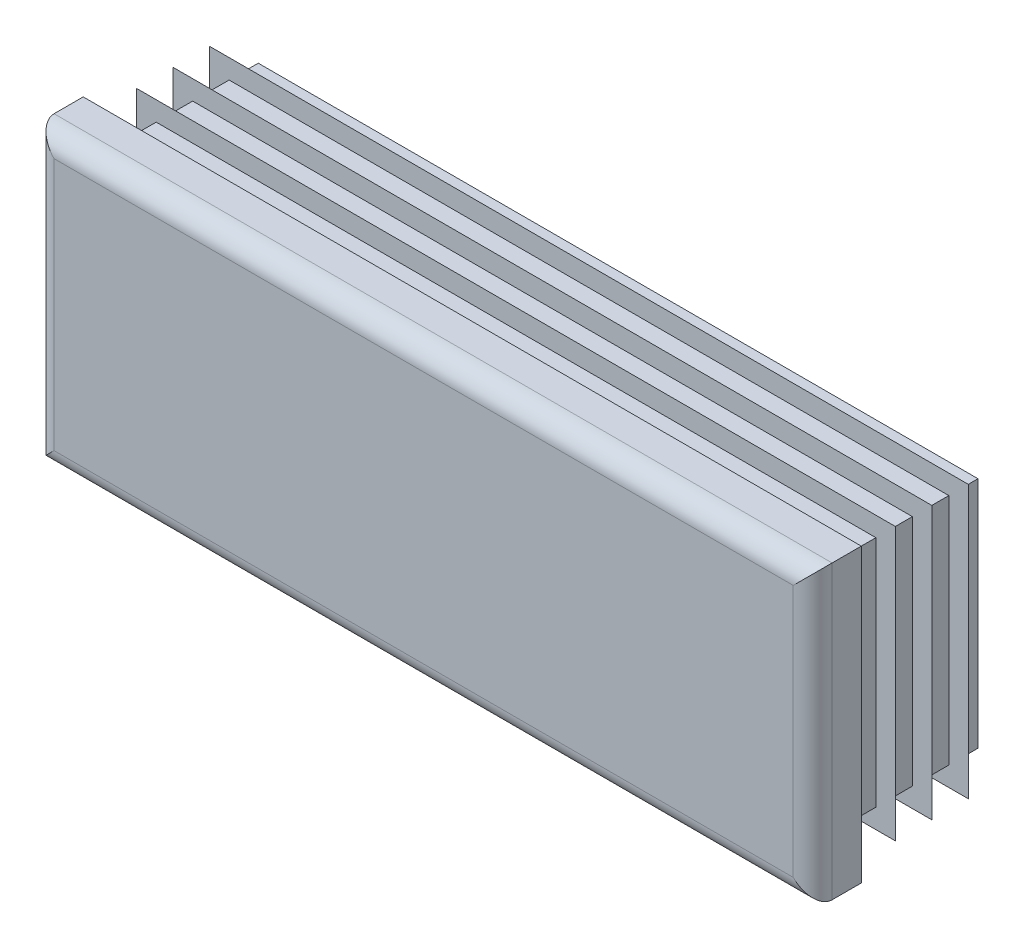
ISO-10303-21;
HEADER;
FILE_DESCRIPTION(('STEP AP214'),'2;1');
FILE_NAME('part.step','',(''),(''),'','','');
FILE_SCHEMA(('AUTOMOTIVE_DESIGN { 1 0 10303 214 1 1 1 1 }'));
ENDSEC;
DATA;
#1=APPLICATION_CONTEXT('core data for automotive mechanical design processes');
#2=APPLICATION_PROTOCOL_DEFINITION('international standard','automotive_design',2000,#1);
#3=PRODUCT_CONTEXT('',#1,'mechanical');
#4=PRODUCT('Part','Part','',(#3));
#5=PRODUCT_RELATED_PRODUCT_CATEGORY('part','',(#4));
#6=PRODUCT_DEFINITION_FORMATION('','',#4);
#7=PRODUCT_DEFINITION_CONTEXT('part definition',#1,'design');
#8=PRODUCT_DEFINITION('design','',#6,#7);
#9=PRODUCT_DEFINITION_SHAPE('','',#8);
#10=(LENGTH_UNIT() NAMED_UNIT(*) SI_UNIT(.MILLI.,.METRE.));
#11=(NAMED_UNIT(*) PLANE_ANGLE_UNIT() SI_UNIT($,.RADIAN.));
#12=(NAMED_UNIT(*) SI_UNIT($,.STERADIAN.) SOLID_ANGLE_UNIT());
#13=UNCERTAINTY_MEASURE_WITH_UNIT(LENGTH_MEASURE(1.E-05),#10,'distance_accuracy_value','');
#14=(GEOMETRIC_REPRESENTATION_CONTEXT(3) GLOBAL_UNCERTAINTY_ASSIGNED_CONTEXT((#13)) GLOBAL_UNIT_ASSIGNED_CONTEXT((#10,
#11,#12)) REPRESENTATION_CONTEXT('',''));
#15=CARTESIAN_POINT('',(0.,0.,0.));
#16=DIRECTION('',(0.,0.,1.));
#17=DIRECTION('',(1.,0.,0.));
#18=AXIS2_PLACEMENT_3D('',#15,#16,#17);
#19=CARTESIAN_POINT('',(38.,-15.,5.));
#20=DIRECTION('',(0.,0.,-1.));
#21=DIRECTION('',(0.,1.,0.));
#22=AXIS2_PLACEMENT_3D('',#19,#20,#21);
#23=PLANE('',#22);
#24=DIRECTION('',(0.,1.,0.));
#25=VECTOR('',#24,1.);
#26=CARTESIAN_POINT('',(-38.,-15.,5.));
#27=LINE('',#26,#25);
#28=CARTESIAN_POINT('',(-38.,-13.,5.));
#29=VERTEX_POINT('',#28);
#30=CARTESIAN_POINT('',(-38.,13.,5.));
#31=VERTEX_POINT('',#30);
#32=EDGE_CURVE('E310',#29,#31,#27,.T.);
#33=ORIENTED_EDGE('',*,*,#32,.F.);
#34=DIRECTION('',(-1.,0.,0.));
#35=VECTOR('',#34,1.);
#36=CARTESIAN_POINT('',(40.,-13.,5.));
#37=LINE('',#36,#35);
#38=CARTESIAN_POINT('',(38.,-13.,5.));
#39=VERTEX_POINT('',#38);
#40=EDGE_CURVE('E482',#39,#29,#37,.T.);
#41=ORIENTED_EDGE('',*,*,#40,.F.);
#42=DIRECTION('',(0.,1.,0.));
#43=VECTOR('',#42,1.);
#44=CARTESIAN_POINT('',(38.,-15.,5.));
#45=LINE('',#44,#43);
#46=CARTESIAN_POINT('',(38.,13.,5.));
#47=VERTEX_POINT('',#46);
#48=EDGE_CURVE('E305',#39,#47,#45,.T.);
#49=ORIENTED_EDGE('',*,*,#48,.T.);
#50=DIRECTION('',(-1.,0.,0.));
#51=VECTOR('',#50,1.);
#52=CARTESIAN_POINT('',(40.,13.,5.));
#53=LINE('',#52,#51);
#54=EDGE_CURVE('E630',#47,#31,#53,.T.);
#55=ORIENTED_EDGE('',*,*,#54,.T.);
#56=EDGE_LOOP('',(#33,#41,#49,#55));
#57=FACE_BOUND('',#56,.T.);
#58=ADVANCED_FACE('F14',(#57),#23,.F.);
#59=CARTESIAN_POINT('',(-38.,-15.,3.));
#60=DIRECTION('',(0.,1.,0.));
#61=DIRECTION('',(-1.,0.,0.));
#62=AXIS2_PLACEMENT_3D('',#59,#60,#61);
#63=CYLINDRICAL_SURFACE('',#62,2.);
#64=DIRECTION('',(0.,1.,0.));
#65=VECTOR('',#64,1.);
#66=CARTESIAN_POINT('',(-40.,-15.,3.));
#67=LINE('',#66,#65);
#68=CARTESIAN_POINT('',(-40.,-15.,3.));
#69=VERTEX_POINT('',#68);
#70=CARTESIAN_POINT('',(-40.,15.,3.));
#71=VERTEX_POINT('',#70);
#72=EDGE_CURVE('E402',#69,#71,#67,.T.);
#73=ORIENTED_EDGE('',*,*,#72,.F.);
#74=CARTESIAN_POINT('',(-38.,-13.,3.));
#75=DIRECTION('',(-0.707106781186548,0.707106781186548,0.));
#76=DIRECTION('',(0.707106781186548,0.707106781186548,0.));
#77=AXIS2_PLACEMENT_3D('',#74,#75,#76);
#78=ELLIPSE('',#77,2.82842712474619,2.);
#79=EDGE_CURVE('E59',#69,#29,#78,.T.);
#80=ORIENTED_EDGE('',*,*,#79,.T.);
#81=ORIENTED_EDGE('',*,*,#32,.T.);
#82=CARTESIAN_POINT('',(-38.,13.,3.));
#83=DIRECTION('',(0.707106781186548,0.707106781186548,0.));
#84=DIRECTION('',(-0.707106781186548,0.707106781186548,0.));
#85=AXIS2_PLACEMENT_3D('',#82,#83,#84);
#86=ELLIPSE('',#85,2.82842712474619,2.);
#87=EDGE_CURVE('E306',#31,#71,#86,.F.);
#88=ORIENTED_EDGE('',*,*,#87,.T.);
#89=EDGE_LOOP('',(#73,#80,#81,#88));
#90=FACE_BOUND('',#89,.T.);
#91=ADVANCED_FACE('F16',(#90),#63,.T.);
#92=CARTESIAN_POINT('',(-40.,-15.,3.));
#93=DIRECTION('',(1.,0.,0.));
#94=DIRECTION('',(0.,1.,0.));
#95=AXIS2_PLACEMENT_3D('',#92,#93,#94);
#96=PLANE('',#95);
#97=DIRECTION('',(0.,0.,-1.));
#98=VECTOR('',#97,1.);
#99=CARTESIAN_POINT('',(-40.,15.,3.));
#100=LINE('',#99,#98);
#101=CARTESIAN_POINT('',(-40.,15.,0.));
#102=VERTEX_POINT('',#101);
#103=EDGE_CURVE('E615',#71,#102,#100,.T.);
#104=ORIENTED_EDGE('',*,*,#103,.T.);
#105=DIRECTION('',(0.,1.,0.));
#106=VECTOR('',#105,1.);
#107=CARTESIAN_POINT('',(-40.,-15.,0.));
#108=LINE('',#107,#106);
#109=CARTESIAN_POINT('',(-40.,-15.,0.));
#110=VERTEX_POINT('',#109);
#111=EDGE_CURVE('E400',#110,#102,#108,.T.);
#112=ORIENTED_EDGE('',*,*,#111,.F.);
#113=DIRECTION('',(0.,0.,-1.));
#114=VECTOR('',#113,1.);
#115=CARTESIAN_POINT('',(-40.,-15.,3.));
#116=LINE('',#115,#114);
#117=EDGE_CURVE('E616',#69,#110,#116,.T.);
#118=ORIENTED_EDGE('',*,*,#117,.F.);
#119=ORIENTED_EDGE('',*,*,#72,.T.);
#120=EDGE_LOOP('',(#104,#112,#118,#119));
#121=FACE_BOUND('',#120,.T.);
#122=ADVANCED_FACE('F697',(#121),#96,.F.);
#123=CARTESIAN_POINT('',(-37.,-15.,0.));
#124=DIRECTION('',(1.,0.,0.));
#125=DIRECTION('',(0.,1.,0.));
#126=AXIS2_PLACEMENT_3D('',#123,#124,#125);
#127=PLANE('',#126);
#128=DIRECTION('',(0.,1.,0.));
#129=VECTOR('',#128,1.);
#130=CARTESIAN_POINT('',(-37.,-15.,0.));
#131=LINE('',#130,#129);
#132=CARTESIAN_POINT('',(-37.,-12.,0.));
#133=VERTEX_POINT('',#132);
#134=CARTESIAN_POINT('',(-37.,12.,0.));
#135=VERTEX_POINT('',#134);
#136=EDGE_CURVE('E397',#133,#135,#131,.T.);
#137=ORIENTED_EDGE('',*,*,#136,.T.);
#138=DIRECTION('',(0.,0.,-1.));
#139=VECTOR('',#138,1.);
#140=CARTESIAN_POINT('',(-37.,12.,0.));
#141=LINE('',#140,#139);
#142=CARTESIAN_POINT('',(-37.,12.,-0.75));
#143=VERTEX_POINT('',#142);
#144=EDGE_CURVE('E495',#135,#143,#141,.T.);
#145=ORIENTED_EDGE('',*,*,#144,.T.);
#146=DIRECTION('',(0.,1.,0.));
#147=VECTOR('',#146,1.);
#148=CARTESIAN_POINT('',(-37.,-15.,-0.75));
#149=LINE('',#148,#147);
#150=CARTESIAN_POINT('',(-37.,-12.,-0.75));
#151=VERTEX_POINT('',#150);
#152=EDGE_CURVE('E394',#151,#143,#149,.T.);
#153=ORIENTED_EDGE('',*,*,#152,.F.);
#154=DIRECTION('',(0.,0.,1.));
#155=VECTOR('',#154,1.);
#156=CARTESIAN_POINT('',(-37.,-12.,0.));
#157=LINE('',#156,#155);
#158=EDGE_CURVE('E489',#151,#133,#157,.T.);
#159=ORIENTED_EDGE('',*,*,#158,.T.);
#160=EDGE_LOOP('',(#137,#145,#153,#159));
#161=FACE_BOUND('',#160,.T.);
#162=ADVANCED_FACE('F787',(#161),#127,.F.);
#163=CARTESIAN_POINT('',(-39.,-15.,-0.75));
#164=DIRECTION('',(0.342020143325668,0.,0.939692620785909));
#165=DIRECTION('',(-0.939692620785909,0.,0.342020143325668));
#166=AXIS2_PLACEMENT_3D('',#163,#164,#165);
#167=PLANE('',#166);
#168=DIRECTION('',(0.,1.,0.));
#169=VECTOR('',#168,1.);
#170=CARTESIAN_POINT('',(-39.,-15.,-0.75));
#171=LINE('',#170,#169);
#172=CARTESIAN_POINT('',(-39.,-14.,-0.75));
#173=VERTEX_POINT('',#172);
#174=CARTESIAN_POINT('',(-39.,14.,-0.75));
#175=VERTEX_POINT('',#174);
#176=EDGE_CURVE('E392',#173,#175,#171,.T.);
#177=ORIENTED_EDGE('',*,*,#176,.T.);
#178=DIRECTION('',(0.844349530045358,-0.43889572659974,-0.307318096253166));
#179=VECTOR('',#178,1.);
#180=CARTESIAN_POINT('',(-28.2531393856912,8.41374569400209,-4.66153737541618));
#181=LINE('',#180,#179);
#182=CARTESIAN_POINT('',(-37.,12.9603932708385,-1.4779404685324));
#183=VERTEX_POINT('',#182);
#184=EDGE_CURVE('E519',#175,#183,#181,.T.);
#185=ORIENTED_EDGE('',*,*,#184,.T.);
#186=DIRECTION('',(0.,1.,0.));
#187=VECTOR('',#186,1.);
#188=CARTESIAN_POINT('',(-37.,-15.,-1.4779404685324));
#189=LINE('',#188,#187);
#190=CARTESIAN_POINT('',(-37.,-12.9603932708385,-1.4779404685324));
#191=VERTEX_POINT('',#190);
#192=EDGE_CURVE('E389',#191,#183,#189,.T.);
#193=ORIENTED_EDGE('',*,*,#192,.F.);
#194=DIRECTION('',(-0.844349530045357,-0.43889572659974,0.307318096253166));
#195=VECTOR('',#194,1.);
#196=CARTESIAN_POINT('',(-39.3705814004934,-14.1926294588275,-0.615119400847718));
#197=LINE('',#196,#195);
#198=EDGE_CURVE('E507',#191,#173,#197,.T.);
#199=ORIENTED_EDGE('',*,*,#198,.T.);
#200=EDGE_LOOP('',(#177,#185,#193,#199));
#201=FACE_BOUND('',#200,.T.);
#202=ADVANCED_FACE('F783',(#201),#167,.F.);
#203=CARTESIAN_POINT('',(-37.,-15.,-1.4779404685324));
#204=DIRECTION('',(1.,0.,0.));
#205=DIRECTION('',(0.,1.,0.));
#206=AXIS2_PLACEMENT_3D('',#203,#204,#205);
#207=PLANE('',#206);
#208=ORIENTED_EDGE('',*,*,#192,.T.);
#209=DIRECTION('',(0.,-0.819152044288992,-0.573576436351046));
#210=VECTOR('',#209,1.);
#211=CARTESIAN_POINT('',(-37.,-5.80131222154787,-14.6150280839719));
#212=LINE('',#211,#210);
#213=CARTESIAN_POINT('',(-37.,12.,-2.15041507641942));
#214=VERTEX_POINT('',#213);
#215=EDGE_CURVE('E516',#183,#214,#212,.T.);
#216=ORIENTED_EDGE('',*,*,#215,.T.);
#217=DIRECTION('',(0.,0.,-1.));
#218=VECTOR('',#217,1.);
#219=CARTESIAN_POINT('',(-37.,12.,-1.4779404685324));
#220=LINE('',#219,#218);
#221=CARTESIAN_POINT('',(-37.,12.,-4.5));
#222=VERTEX_POINT('',#221);
#223=EDGE_CURVE('E525',#214,#222,#220,.T.);
#224=ORIENTED_EDGE('',*,*,#223,.T.);
#225=DIRECTION('',(0.,1.,0.));
#226=VECTOR('',#225,1.);
#227=CARTESIAN_POINT('',(-37.,-15.,-4.5));
#228=LINE('',#227,#226);
#229=CARTESIAN_POINT('',(-37.,-12.,-4.5));
#230=VERTEX_POINT('',#229);
#231=EDGE_CURVE('E386',#230,#222,#228,.T.);
#232=ORIENTED_EDGE('',*,*,#231,.F.);
#233=DIRECTION('',(0.,0.,1.));
#234=VECTOR('',#233,1.);
#235=CARTESIAN_POINT('',(-37.,-12.,-1.4779404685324));
#236=LINE('',#235,#234);
#237=CARTESIAN_POINT('',(-37.,-12.,-2.15041507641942));
#238=VERTEX_POINT('',#237);
#239=EDGE_CURVE('E522',#230,#238,#236,.T.);
#240=ORIENTED_EDGE('',*,*,#239,.T.);
#241=DIRECTION('',(0.,-0.819152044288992,0.573576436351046));
#242=VECTOR('',#241,1.);
#243=CARTESIAN_POINT('',(-37.,-14.3289899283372,-0.519638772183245));
#244=LINE('',#243,#242);
#245=EDGE_CURVE('E504',#238,#191,#244,.T.);
#246=ORIENTED_EDGE('',*,*,#245,.T.);
#247=EDGE_LOOP('',(#208,#216,#224,#232,#240,#246));
#248=FACE_BOUND('',#247,.T.);
#249=ADVANCED_FACE('F779',(#248),#207,.F.);
#250=CARTESIAN_POINT('',(-39.,-15.,-4.5));
#251=DIRECTION('',(0.342020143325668,0.,0.939692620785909));
#252=DIRECTION('',(-0.939692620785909,0.,0.342020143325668));
#253=AXIS2_PLACEMENT_3D('',#250,#251,#252);
#254=PLANE('',#253);
#255=DIRECTION('',(0.,1.,0.));
#256=VECTOR('',#255,1.);
#257=CARTESIAN_POINT('',(-39.,-15.,-4.5));
#258=LINE('',#257,#256);
#259=CARTESIAN_POINT('',(-39.,-14.,-4.5));
#260=VERTEX_POINT('',#259);
#261=CARTESIAN_POINT('',(-39.,14.,-4.5));
#262=VERTEX_POINT('',#261);
#263=EDGE_CURVE('E384',#260,#262,#258,.T.);
#264=ORIENTED_EDGE('',*,*,#263,.T.);
#265=DIRECTION('',(0.844349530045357,-0.43889572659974,-0.307318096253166));
#266=VECTOR('',#265,1.);
#267=CARTESIAN_POINT('',(-28.2531393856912,8.41374569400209,-8.41153737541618));
#268=LINE('',#267,#266);
#269=CARTESIAN_POINT('',(-37.,12.9603932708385,-5.2279404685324));
#270=VERTEX_POINT('',#269);
#271=EDGE_CURVE('E549',#262,#270,#268,.T.);
#272=ORIENTED_EDGE('',*,*,#271,.T.);
#273=DIRECTION('',(0.,1.,0.));
#274=VECTOR('',#273,1.);
#275=CARTESIAN_POINT('',(-37.,-15.,-5.2279404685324));
#276=LINE('',#275,#274);
#277=CARTESIAN_POINT('',(-37.,-12.9603932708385,-5.2279404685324));
#278=VERTEX_POINT('',#277);
#279=EDGE_CURVE('E381',#278,#270,#276,.T.);
#280=ORIENTED_EDGE('',*,*,#279,.F.);
#281=DIRECTION('',(-0.844349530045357,-0.43889572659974,0.307318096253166));
#282=VECTOR('',#281,1.);
#283=CARTESIAN_POINT('',(-39.3705814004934,-14.1926294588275,-4.36511940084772));
#284=LINE('',#283,#282);
#285=EDGE_CURVE('E537',#278,#260,#284,.T.);
#286=ORIENTED_EDGE('',*,*,#285,.T.);
#287=EDGE_LOOP('',(#264,#272,#280,#286));
#288=FACE_BOUND('',#287,.T.);
#289=ADVANCED_FACE('F775',(#288),#254,.F.);
#290=CARTESIAN_POINT('',(-37.,-15.,-5.2279404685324));
#291=DIRECTION('',(1.,0.,0.));
#292=DIRECTION('',(0.,1.,0.));
#293=AXIS2_PLACEMENT_3D('',#290,#291,#292);
#294=PLANE('',#293);
#295=ORIENTED_EDGE('',*,*,#279,.T.);
#296=DIRECTION('',(0.,-0.819152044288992,-0.573576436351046));
#297=VECTOR('',#296,1.);
#298=CARTESIAN_POINT('',(-37.,-5.80131222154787,-18.3650280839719));
#299=LINE('',#298,#297);
#300=CARTESIAN_POINT('',(-37.,12.,-5.90041507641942));
#301=VERTEX_POINT('',#300);
#302=EDGE_CURVE('E546',#270,#301,#299,.T.);
#303=ORIENTED_EDGE('',*,*,#302,.T.);
#304=DIRECTION('',(0.,0.,-1.));
#305=VECTOR('',#304,1.);
#306=CARTESIAN_POINT('',(-37.,12.,-5.2279404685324));
#307=LINE('',#306,#305);
#308=CARTESIAN_POINT('',(-37.,12.,-8.25));
#309=VERTEX_POINT('',#308);
#310=EDGE_CURVE('E555',#301,#309,#307,.T.);
#311=ORIENTED_EDGE('',*,*,#310,.T.);
#312=DIRECTION('',(0.,1.,0.));
#313=VECTOR('',#312,1.);
#314=CARTESIAN_POINT('',(-37.,-15.,-8.25));
#315=LINE('',#314,#313);
#316=CARTESIAN_POINT('',(-37.,-12.,-8.25));
#317=VERTEX_POINT('',#316);
#318=EDGE_CURVE('E378',#317,#309,#315,.T.);
#319=ORIENTED_EDGE('',*,*,#318,.F.);
#320=DIRECTION('',(0.,0.,1.));
#321=VECTOR('',#320,1.);
#322=CARTESIAN_POINT('',(-37.,-12.,-5.2279404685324));
#323=LINE('',#322,#321);
#324=CARTESIAN_POINT('',(-37.,-12.,-5.90041507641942));
#325=VERTEX_POINT('',#324);
#326=EDGE_CURVE('E552',#317,#325,#323,.T.);
#327=ORIENTED_EDGE('',*,*,#326,.T.);
#328=DIRECTION('',(0.,-0.819152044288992,0.573576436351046));
#329=VECTOR('',#328,1.);
#330=CARTESIAN_POINT('',(-37.,-14.3289899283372,-4.26963877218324));
#331=LINE('',#330,#329);
#332=EDGE_CURVE('E534',#325,#278,#331,.T.);
#333=ORIENTED_EDGE('',*,*,#332,.T.);
#334=EDGE_LOOP('',(#295,#303,#311,#319,#327,#333));
#335=FACE_BOUND('',#334,.T.);
#336=ADVANCED_FACE('F771',(#335),#294,.F.);
#337=CARTESIAN_POINT('',(-39.,-15.,-8.25));
#338=DIRECTION('',(0.342020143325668,0.,0.939692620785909));
#339=DIRECTION('',(-0.939692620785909,0.,0.342020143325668));
#340=AXIS2_PLACEMENT_3D('',#337,#338,#339);
#341=PLANE('',#340);
#342=DIRECTION('',(0.,1.,0.));
#343=VECTOR('',#342,1.);
#344=CARTESIAN_POINT('',(-39.,-15.,-8.25));
#345=LINE('',#344,#343);
#346=CARTESIAN_POINT('',(-39.,-14.,-8.25));
#347=VERTEX_POINT('',#346);
#348=CARTESIAN_POINT('',(-39.,14.,-8.25));
#349=VERTEX_POINT('',#348);
#350=EDGE_CURVE('E376',#347,#349,#345,.T.);
#351=ORIENTED_EDGE('',*,*,#350,.T.);
#352=DIRECTION('',(0.844349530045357,-0.43889572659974,-0.307318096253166));
#353=VECTOR('',#352,1.);
#354=CARTESIAN_POINT('',(-28.2531393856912,8.41374569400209,-12.1615373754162));
#355=LINE('',#354,#353);
#356=CARTESIAN_POINT('',(-37.,12.9603932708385,-8.97794046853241));
#357=VERTEX_POINT('',#356);
#358=EDGE_CURVE('E579',#349,#357,#355,.T.);
#359=ORIENTED_EDGE('',*,*,#358,.T.);
#360=DIRECTION('',(0.,1.,0.));
#361=VECTOR('',#360,1.);
#362=CARTESIAN_POINT('',(-37.,-15.,-8.9779404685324));
#363=LINE('',#362,#361);
#364=CARTESIAN_POINT('',(-37.,-12.9603932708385,-8.9779404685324));
#365=VERTEX_POINT('',#364);
#366=EDGE_CURVE('E373',#365,#357,#363,.T.);
#367=ORIENTED_EDGE('',*,*,#366,.F.);
#368=DIRECTION('',(-0.844349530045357,-0.438895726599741,0.307318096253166));
#369=VECTOR('',#368,1.);
#370=CARTESIAN_POINT('',(-39.3705814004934,-14.1926294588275,-8.11511940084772));
#371=LINE('',#370,#369);
#372=EDGE_CURVE('E567',#365,#347,#371,.T.);
#373=ORIENTED_EDGE('',*,*,#372,.T.);
#374=EDGE_LOOP('',(#351,#359,#367,#373));
#375=FACE_BOUND('',#374,.T.);
#376=ADVANCED_FACE('F767',(#375),#341,.F.);
#377=CARTESIAN_POINT('',(-37.,-15.,-8.9779404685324));
#378=DIRECTION('',(1.,0.,0.));
#379=DIRECTION('',(0.,1.,0.));
#380=AXIS2_PLACEMENT_3D('',#377,#378,#379);
#381=PLANE('',#380);
#382=ORIENTED_EDGE('',*,*,#366,.T.);
#383=DIRECTION('',(0.,-0.819152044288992,-0.573576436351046));
#384=VECTOR('',#383,1.);
#385=CARTESIAN_POINT('',(-37.,-5.80131222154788,-22.1150280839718));
#386=LINE('',#385,#384);
#387=CARTESIAN_POINT('',(-37.,12.,-9.65041507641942));
#388=VERTEX_POINT('',#387);
#389=EDGE_CURVE('E576',#357,#388,#386,.T.);
#390=ORIENTED_EDGE('',*,*,#389,.T.);
#391=DIRECTION('',(0.,0.,-1.));
#392=VECTOR('',#391,1.);
#393=CARTESIAN_POINT('',(-37.,12.,-8.9779404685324));
#394=LINE('',#393,#392);
#395=CARTESIAN_POINT('',(-37.,12.,-12.));
#396=VERTEX_POINT('',#395);
#397=EDGE_CURVE('E585',#388,#396,#394,.T.);
#398=ORIENTED_EDGE('',*,*,#397,.T.);
#399=DIRECTION('',(0.,1.,0.));
#400=VECTOR('',#399,1.);
#401=CARTESIAN_POINT('',(-37.,-15.,-12.));
#402=LINE('',#401,#400);
#403=CARTESIAN_POINT('',(-37.,-12.,-12.));
#404=VERTEX_POINT('',#403);
#405=EDGE_CURVE('E370',#404,#396,#402,.T.);
#406=ORIENTED_EDGE('',*,*,#405,.F.);
#407=DIRECTION('',(0.,0.,1.));
#408=VECTOR('',#407,1.);
#409=CARTESIAN_POINT('',(-37.,-12.,-8.9779404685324));
#410=LINE('',#409,#408);
#411=CARTESIAN_POINT('',(-37.,-12.,-9.65041507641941));
#412=VERTEX_POINT('',#411);
#413=EDGE_CURVE('E582',#404,#412,#410,.T.);
#414=ORIENTED_EDGE('',*,*,#413,.T.);
#415=DIRECTION('',(0.,-0.819152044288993,0.573576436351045));
#416=VECTOR('',#415,1.);
#417=CARTESIAN_POINT('',(-37.,-14.3289899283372,-8.01963877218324));
#418=LINE('',#417,#416);
#419=EDGE_CURVE('E564',#412,#365,#418,.T.);
#420=ORIENTED_EDGE('',*,*,#419,.T.);
#421=EDGE_LOOP('',(#382,#390,#398,#406,#414,#420));
#422=FACE_BOUND('',#421,.T.);
#423=ADVANCED_FACE('F764',(#422),#381,.F.);
#424=CARTESIAN_POINT('',(-39.,-15.,-12.));
#425=DIRECTION('',(0.342020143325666,0.,0.939692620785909));
#426=DIRECTION('',(-0.939692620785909,0.,0.342020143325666));
#427=AXIS2_PLACEMENT_3D('',#424,#425,#426);
#428=PLANE('',#427);
#429=DIRECTION('',(0.,1.,0.));
#430=VECTOR('',#429,1.);
#431=CARTESIAN_POINT('',(-39.,-15.,-12.));
#432=LINE('',#431,#430);
#433=CARTESIAN_POINT('',(-39.,-14.,-12.));
#434=VERTEX_POINT('',#433);
#435=CARTESIAN_POINT('',(-39.,14.,-12.));
#436=VERTEX_POINT('',#435);
#437=EDGE_CURVE('E368',#434,#436,#432,.T.);
#438=ORIENTED_EDGE('',*,*,#437,.T.);
#439=DIRECTION('',(0.844349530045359,-0.438895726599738,-0.307318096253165));
#440=VECTOR('',#439,1.);
#441=CARTESIAN_POINT('',(-28.2531393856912,8.41374569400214,-15.9115373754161));
#442=LINE('',#441,#440);
#443=CARTESIAN_POINT('',(-37.,12.9603932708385,-12.7279404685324));
#444=VERTEX_POINT('',#443);
#445=EDGE_CURVE('E607',#436,#444,#442,.T.);
#446=ORIENTED_EDGE('',*,*,#445,.T.);
#447=DIRECTION('',(0.,1.,0.));
#448=VECTOR('',#447,1.);
#449=CARTESIAN_POINT('',(-37.,-15.,-12.7279404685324));
#450=LINE('',#449,#448);
#451=CARTESIAN_POINT('',(-37.,-12.9603932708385,-12.7279404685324));
#452=VERTEX_POINT('',#451);
#453=EDGE_CURVE('E365',#452,#444,#450,.T.);
#454=ORIENTED_EDGE('',*,*,#453,.F.);
#455=DIRECTION('',(-0.844349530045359,-0.438895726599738,0.307318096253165));
#456=VECTOR('',#455,1.);
#457=CARTESIAN_POINT('',(-39.3705814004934,-14.1926294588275,-11.8651194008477));
#458=LINE('',#457,#456);
#459=EDGE_CURVE('E595',#452,#434,#458,.T.);
#460=ORIENTED_EDGE('',*,*,#459,.T.);
#461=EDGE_LOOP('',(#438,#446,#454,#460));
#462=FACE_BOUND('',#461,.T.);
#463=ADVANCED_FACE('F675',(#462),#428,.F.);
#464=CARTESIAN_POINT('',(-37.,-15.,-12.7279404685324));
#465=DIRECTION('',(1.,0.,0.));
#466=DIRECTION('',(0.,1.,0.));
#467=AXIS2_PLACEMENT_3D('',#464,#465,#466);
#468=PLANE('',#467);
#469=ORIENTED_EDGE('',*,*,#453,.T.);
#470=DIRECTION('',(0.,-0.819152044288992,-0.573576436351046));
#471=VECTOR('',#470,1.);
#472=CARTESIAN_POINT('',(-37.,-5.80131222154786,-25.8650280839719));
#473=LINE('',#472,#471);
#474=CARTESIAN_POINT('',(-37.,12.,-13.4004150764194));
#475=VERTEX_POINT('',#474);
#476=EDGE_CURVE('E604',#444,#475,#473,.T.);
#477=ORIENTED_EDGE('',*,*,#476,.T.);
#478=DIRECTION('',(0.,0.,-1.));
#479=VECTOR('',#478,1.);
#480=CARTESIAN_POINT('',(-37.,12.,-12.7279404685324));
#481=LINE('',#480,#479);
#482=CARTESIAN_POINT('',(-37.,12.,-15.));
#483=VERTEX_POINT('',#482);
#484=EDGE_CURVE('E613',#475,#483,#481,.T.);
#485=ORIENTED_EDGE('',*,*,#484,.T.);
#486=DIRECTION('',(0.,1.,0.));
#487=VECTOR('',#486,1.);
#488=CARTESIAN_POINT('',(-37.,-15.,-15.));
#489=LINE('',#488,#487);
#490=CARTESIAN_POINT('',(-37.,-12.,-15.));
#491=VERTEX_POINT('',#490);
#492=EDGE_CURVE('E362',#491,#483,#489,.T.);
#493=ORIENTED_EDGE('',*,*,#492,.F.);
#494=DIRECTION('',(0.,0.,1.));
#495=VECTOR('',#494,1.);
#496=CARTESIAN_POINT('',(-37.,-12.,-12.7279404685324));
#497=LINE('',#496,#495);
#498=CARTESIAN_POINT('',(-37.,-12.,-13.4004150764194));
#499=VERTEX_POINT('',#498);
#500=EDGE_CURVE('E610',#491,#499,#497,.T.);
#501=ORIENTED_EDGE('',*,*,#500,.T.);
#502=DIRECTION('',(0.,-0.819152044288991,0.573576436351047));
#503=VECTOR('',#502,1.);
#504=CARTESIAN_POINT('',(-37.,-14.3289899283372,-11.7696387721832));
#505=LINE('',#504,#503);
#506=EDGE_CURVE('E592',#499,#452,#505,.T.);
#507=ORIENTED_EDGE('',*,*,#506,.T.);
#508=EDGE_LOOP('',(#469,#477,#485,#493,#501,#507));
#509=FACE_BOUND('',#508,.T.);
#510=ADVANCED_FACE('F677',(#509),#468,.F.);
#511=CARTESIAN_POINT('',(-37.,-15.,-15.));
#512=DIRECTION('',(0.,0.,1.));
#513=DIRECTION('',(0.,-1.,0.));
#514=AXIS2_PLACEMENT_3D('',#511,#512,#513);
#515=PLANE('',#514);
#516=ORIENTED_EDGE('',*,*,#492,.T.);
#517=DIRECTION('',(-1.,0.,0.));
#518=VECTOR('',#517,1.);
#519=CARTESIAN_POINT('',(40.,12.,-15.));
#520=LINE('',#519,#518);
#521=CARTESIAN_POINT('',(37.,12.,-15.));
#522=VERTEX_POINT('',#521);
#523=EDGE_CURVE('E438',#522,#483,#520,.T.);
#524=ORIENTED_EDGE('',*,*,#523,.F.);
#525=DIRECTION('',(0.,1.,0.));
#526=VECTOR('',#525,1.);
#527=CARTESIAN_POINT('',(37.,-15.,-15.));
#528=LINE('',#527,#526);
#529=CARTESIAN_POINT('',(37.,-12.,-15.));
#530=VERTEX_POINT('',#529);
#531=EDGE_CURVE('E359',#530,#522,#528,.T.);
#532=ORIENTED_EDGE('',*,*,#531,.F.);
#533=DIRECTION('',(-1.,0.,0.));
#534=VECTOR('',#533,1.);
#535=CARTESIAN_POINT('',(40.,-12.,-15.));
#536=LINE('',#535,#534);
#537=EDGE_CURVE('E436',#530,#491,#536,.T.);
#538=ORIENTED_EDGE('',*,*,#537,.T.);
#539=EDGE_LOOP('',(#516,#524,#532,#538));
#540=FACE_BOUND('',#539,.T.);
#541=ADVANCED_FACE('F435',(#540),#515,.F.);
#542=CARTESIAN_POINT('',(37.,-15.,-15.));
#543=DIRECTION('',(-1.,0.,0.));
#544=DIRECTION('',(0.,-1.,0.));
#545=AXIS2_PLACEMENT_3D('',#542,#543,#544);
#546=PLANE('',#545);
#547=DIRECTION('',(0.,0.,1.));
#548=VECTOR('',#547,1.);
#549=CARTESIAN_POINT('',(37.,12.,-15.));
#550=LINE('',#549,#548);
#551=CARTESIAN_POINT('',(37.,12.,-13.4004150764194));
#552=VERTEX_POINT('',#551);
#553=EDGE_CURVE('E9',#522,#552,#550,.T.);
#554=ORIENTED_EDGE('',*,*,#553,.T.);
#555=DIRECTION('',(0.,0.819152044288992,0.573576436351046));
#556=VECTOR('',#555,1.);
#557=CARTESIAN_POINT('',(37.,-6.86883100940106,-26.6125127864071));
#558=LINE('',#557,#556);
#559=CARTESIAN_POINT('',(37.,12.9603932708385,-12.7279404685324));
#560=VERTEX_POINT('',#559);
#561=EDGE_CURVE('E601',#552,#560,#558,.T.);
#562=ORIENTED_EDGE('',*,*,#561,.T.);
#563=DIRECTION('',(0.,1.,0.));
#564=VECTOR('',#563,1.);
#565=CARTESIAN_POINT('',(37.,-15.,-12.7279404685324));
#566=LINE('',#565,#564);
#567=CARTESIAN_POINT('',(37.,-12.9603932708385,-12.7279404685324));
#568=VERTEX_POINT('',#567);
#569=EDGE_CURVE('E356',#568,#560,#566,.T.);
#570=ORIENTED_EDGE('',*,*,#569,.F.);
#571=DIRECTION('',(0.,0.819152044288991,-0.573576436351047));
#572=VECTOR('',#571,1.);
#573=CARTESIAN_POINT('',(37.,-13.261471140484,-12.5171234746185));
#574=LINE('',#573,#572);
#575=CARTESIAN_POINT('',(37.,-12.,-13.4004150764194));
#576=VERTEX_POINT('',#575);
#577=EDGE_CURVE('E428',#568,#576,#574,.T.);
#578=ORIENTED_EDGE('',*,*,#577,.T.);
#579=DIRECTION('',(0.,0.,-1.));
#580=VECTOR('',#579,1.);
#581=CARTESIAN_POINT('',(37.,-12.,-15.));
#582=LINE('',#581,#580);
#583=EDGE_CURVE('E23',#576,#530,#582,.T.);
#584=ORIENTED_EDGE('',*,*,#583,.T.);
#585=ORIENTED_EDGE('',*,*,#531,.T.);
#586=EDGE_LOOP('',(#554,#562,#570,#578,#584,#585));
#587=FACE_BOUND('',#586,.T.);
#588=ADVANCED_FACE('F426',(#587),#546,.F.);
#589=CARTESIAN_POINT('',(37.,-15.,-12.7279404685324));
#590=DIRECTION('',(-0.342020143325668,0.,0.939692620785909));
#591=DIRECTION('',(-0.939692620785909,0.,-0.342020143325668));
#592=AXIS2_PLACEMENT_3D('',#589,#590,#591);
#593=PLANE('',#592);
#594=ORIENTED_EDGE('',*,*,#569,.T.);
#595=DIRECTION('',(0.844349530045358,0.43889572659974,0.307318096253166));
#596=VECTOR('',#595,1.);
#597=CARTESIAN_POINT('',(26.6383983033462,7.57439784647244,-16.4992550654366));
#598=LINE('',#597,#596);
#599=CARTESIAN_POINT('',(39.,14.,-12.));
#600=VERTEX_POINT('',#599);
#601=EDGE_CURVE('E598',#560,#600,#598,.T.);
#602=ORIENTED_EDGE('',*,*,#601,.T.);
#603=DIRECTION('',(0.,1.,0.));
#604=VECTOR('',#603,1.);
#605=CARTESIAN_POINT('',(39.,-15.,-12.));
#606=LINE('',#605,#604);
#607=CARTESIAN_POINT('',(39.,-14.,-12.));
#608=VERTEX_POINT('',#607);
#609=EDGE_CURVE('E353',#608,#600,#606,.T.);
#610=ORIENTED_EDGE('',*,*,#609,.F.);
#611=DIRECTION('',(-0.844349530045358,0.438895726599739,-0.307318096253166));
#612=VECTOR('',#611,1.);
#613=CARTESIAN_POINT('',(37.7558403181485,-13.3532816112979,-12.4528370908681));
#614=LINE('',#613,#612);
#615=EDGE_CURVE('E588',#608,#568,#614,.T.);
#616=ORIENTED_EDGE('',*,*,#615,.T.);
#617=EDGE_LOOP('',(#594,#602,#610,#616));
#618=FACE_BOUND('',#617,.T.);
#619=ADVANCED_FACE('F752',(#618),#593,.F.);
#620=CARTESIAN_POINT('',(39.,-15.,-12.));
#621=DIRECTION('',(0.,0.,-1.));
#622=DIRECTION('',(0.,1.,0.));
#623=AXIS2_PLACEMENT_3D('',#620,#621,#622);
#624=PLANE('',#623);
#625=ORIENTED_EDGE('',*,*,#609,.T.);
#626=DIRECTION('',(-1.,0.,0.));
#627=VECTOR('',#626,1.);
#628=CARTESIAN_POINT('',(40.,14.,-12.));
#629=LINE('',#628,#627);
#630=EDGE_CURVE('E444',#600,#436,#629,.T.);
#631=ORIENTED_EDGE('',*,*,#630,.T.);
#632=ORIENTED_EDGE('',*,*,#437,.F.);
#633=DIRECTION('',(-1.,0.,0.));
#634=VECTOR('',#633,1.);
#635=CARTESIAN_POINT('',(40.,-14.,-12.));
#636=LINE('',#635,#634);
#637=EDGE_CURVE('E451',#608,#434,#636,.T.);
#638=ORIENTED_EDGE('',*,*,#637,.F.);
#639=EDGE_LOOP('',(#625,#631,#632,#638));
#640=FACE_BOUND('',#639,.T.);
#641=ORIENTED_EDGE('',*,*,#405,.T.);
#642=DIRECTION('',(-1.,0.,0.));
#643=VECTOR('',#642,1.);
#644=CARTESIAN_POINT('',(40.,12.,-12.));
#645=LINE('',#644,#643);
#646=CARTESIAN_POINT('',(37.,12.,-12.));
#647=VERTEX_POINT('',#646);
#648=EDGE_CURVE('E663',#647,#396,#645,.T.);
#649=ORIENTED_EDGE('',*,*,#648,.F.);
#650=DIRECTION('',(0.,1.,0.));
#651=VECTOR('',#650,1.);
#652=CARTESIAN_POINT('',(37.,-15.,-12.));
#653=LINE('',#652,#651);
#654=CARTESIAN_POINT('',(37.,-12.,-12.));
#655=VERTEX_POINT('',#654);
#656=EDGE_CURVE('E350',#655,#647,#653,.T.);
#657=ORIENTED_EDGE('',*,*,#656,.F.);
#658=DIRECTION('',(-1.,0.,0.));
#659=VECTOR('',#658,1.);
#660=CARTESIAN_POINT('',(40.,-12.,-12.));
#661=LINE('',#660,#659);
#662=EDGE_CURVE('E453',#655,#404,#661,.T.);
#663=ORIENTED_EDGE('',*,*,#662,.T.);
#664=EDGE_LOOP('',(#641,#649,#657,#663));
#665=FACE_BOUND('',#664,.T.);
#666=ADVANCED_FACE('F667',(#640,#665),#624,.F.);
#667=CARTESIAN_POINT('',(37.,-15.,-12.));
#668=DIRECTION('',(-1.,0.,0.));
#669=DIRECTION('',(0.,-1.,0.));
#670=AXIS2_PLACEMENT_3D('',#667,#668,#669);
#671=PLANE('',#670);
#672=DIRECTION('',(0.,0.,1.));
#673=VECTOR('',#672,1.);
#674=CARTESIAN_POINT('',(37.,12.,-12.));
#675=LINE('',#674,#673);
#676=CARTESIAN_POINT('',(37.,12.,-9.65041507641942));
#677=VERTEX_POINT('',#676);
#678=EDGE_CURVE('E420',#647,#677,#675,.T.);
#679=ORIENTED_EDGE('',*,*,#678,.T.);
#680=DIRECTION('',(0.,0.819152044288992,0.573576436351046));
#681=VECTOR('',#680,1.);
#682=CARTESIAN_POINT('',(37.,-7.22121574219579,-23.1092552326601));
#683=LINE('',#682,#681);
#684=CARTESIAN_POINT('',(37.,12.9603932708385,-8.97794046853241));
#685=VERTEX_POINT('',#684);
#686=EDGE_CURVE('E573',#677,#685,#683,.T.);
#687=ORIENTED_EDGE('',*,*,#686,.T.);
#688=DIRECTION('',(0.,1.,0.));
#689=VECTOR('',#688,1.);
#690=CARTESIAN_POINT('',(37.,-15.,-8.9779404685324));
#691=LINE('',#690,#689);
#692=CARTESIAN_POINT('',(37.,-12.9603932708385,-8.9779404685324));
#693=VERTEX_POINT('',#692);
#694=EDGE_CURVE('E347',#693,#685,#691,.T.);
#695=ORIENTED_EDGE('',*,*,#694,.F.);
#696=DIRECTION('',(0.,0.819152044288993,-0.573576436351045));
#697=VECTOR('',#696,1.);
#698=CARTESIAN_POINT('',(37.,-12.9090864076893,-9.01386592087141));
#699=LINE('',#698,#697);
#700=CARTESIAN_POINT('',(37.,-12.,-9.65041507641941));
#701=VERTEX_POINT('',#700);
#702=EDGE_CURVE('E561',#693,#701,#699,.T.);
#703=ORIENTED_EDGE('',*,*,#702,.T.);
#704=DIRECTION('',(0.,0.,-1.));
#705=VECTOR('',#704,1.);
#706=CARTESIAN_POINT('',(37.,-12.,-12.));
#707=LINE('',#706,#705);
#708=EDGE_CURVE('E417',#701,#655,#707,.T.);
#709=ORIENTED_EDGE('',*,*,#708,.T.);
#710=ORIENTED_EDGE('',*,*,#656,.T.);
#711=EDGE_LOOP('',(#679,#687,#695,#703,#709,#710));
#712=FACE_BOUND('',#711,.T.);
#713=ADVANCED_FACE('F745',(#712),#671,.F.);
#714=CARTESIAN_POINT('',(37.,-15.,-8.9779404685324));
#715=DIRECTION('',(-0.342020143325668,0.,0.939692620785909));
#716=DIRECTION('',(-0.939692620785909,0.,-0.342020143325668));
#717=AXIS2_PLACEMENT_3D('',#714,#715,#716);
#718=PLANE('',#717);
#719=ORIENTED_EDGE('',*,*,#694,.T.);
#720=DIRECTION('',(0.844349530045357,0.43889572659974,0.307318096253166));
#721=VECTOR('',#720,1.);
#722=CARTESIAN_POINT('',(26.6383983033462,7.57439784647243,-12.7492550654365));
#723=LINE('',#722,#721);
#724=CARTESIAN_POINT('',(39.,14.,-8.25));
#725=VERTEX_POINT('',#724);
#726=EDGE_CURVE('E570',#685,#725,#723,.T.);
#727=ORIENTED_EDGE('',*,*,#726,.T.);
#728=DIRECTION('',(0.,1.,0.));
#729=VECTOR('',#728,1.);
#730=CARTESIAN_POINT('',(39.,-15.,-8.25));
#731=LINE('',#730,#729);
#732=CARTESIAN_POINT('',(39.,-14.,-8.25));
#733=VERTEX_POINT('',#732);
#734=EDGE_CURVE('E344',#733,#725,#731,.T.);
#735=ORIENTED_EDGE('',*,*,#734,.F.);
#736=DIRECTION('',(-0.844349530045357,0.438895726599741,-0.307318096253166));
#737=VECTOR('',#736,1.);
#738=CARTESIAN_POINT('',(37.7558403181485,-13.3532816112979,-8.70283709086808));
#739=LINE('',#738,#737);
#740=EDGE_CURVE('E558',#733,#693,#739,.T.);
#741=ORIENTED_EDGE('',*,*,#740,.T.);
#742=EDGE_LOOP('',(#719,#727,#735,#741));
#743=FACE_BOUND('',#742,.T.);
#744=ADVANCED_FACE('F741',(#743),#718,.F.);
#745=CARTESIAN_POINT('',(39.,-15.,-8.25));
#746=DIRECTION('',(0.,0.,-1.));
#747=DIRECTION('',(0.,1.,0.));
#748=AXIS2_PLACEMENT_3D('',#745,#746,#747);
#749=PLANE('',#748);
#750=ORIENTED_EDGE('',*,*,#734,.T.);
#751=DIRECTION('',(-1.,0.,0.));
#752=VECTOR('',#751,1.);
#753=CARTESIAN_POINT('',(40.,14.,-8.25));
#754=LINE('',#753,#752);
#755=EDGE_CURVE('E657',#725,#349,#754,.T.);
#756=ORIENTED_EDGE('',*,*,#755,.T.);
#757=ORIENTED_EDGE('',*,*,#350,.F.);
#758=DIRECTION('',(-1.,0.,0.));
#759=VECTOR('',#758,1.);
#760=CARTESIAN_POINT('',(40.,-14.,-8.25));
#761=LINE('',#760,#759);
#762=EDGE_CURVE('E459',#733,#347,#761,.T.);
#763=ORIENTED_EDGE('',*,*,#762,.F.);
#764=EDGE_LOOP('',(#750,#756,#757,#763));
#765=FACE_BOUND('',#764,.T.);
#766=ORIENTED_EDGE('',*,*,#318,.T.);
#767=DIRECTION('',(-1.,0.,0.));
#768=VECTOR('',#767,1.);
#769=CARTESIAN_POINT('',(40.,12.,-8.25));
#770=LINE('',#769,#768);
#771=CARTESIAN_POINT('',(37.,12.,-8.25));
#772=VERTEX_POINT('',#771);
#773=EDGE_CURVE('E655',#772,#309,#770,.T.);
#774=ORIENTED_EDGE('',*,*,#773,.F.);
#775=DIRECTION('',(0.,1.,0.));
#776=VECTOR('',#775,1.);
#777=CARTESIAN_POINT('',(37.,-15.,-8.25));
#778=LINE('',#777,#776);
#779=CARTESIAN_POINT('',(37.,-12.,-8.25));
#780=VERTEX_POINT('',#779);
#781=EDGE_CURVE('E341',#780,#772,#778,.T.);
#782=ORIENTED_EDGE('',*,*,#781,.F.);
#783=DIRECTION('',(-1.,0.,0.));
#784=VECTOR('',#783,1.);
#785=CARTESIAN_POINT('',(40.,-12.,-8.25));
#786=LINE('',#785,#784);
#787=EDGE_CURVE('E461',#780,#317,#786,.T.);
#788=ORIENTED_EDGE('',*,*,#787,.T.);
#789=EDGE_LOOP('',(#766,#774,#782,#788));
#790=FACE_BOUND('',#789,.T.);
#791=ADVANCED_FACE('F737',(#765,#790),#749,.F.);
#792=CARTESIAN_POINT('',(37.,-15.,-8.25));
#793=DIRECTION('',(-1.,0.,0.));
#794=DIRECTION('',(0.,-1.,0.));
#795=AXIS2_PLACEMENT_3D('',#792,#793,#794);
#796=PLANE('',#795);
#797=DIRECTION('',(0.,0.,1.));
#798=VECTOR('',#797,1.);
#799=CARTESIAN_POINT('',(37.,12.,-8.25));
#800=LINE('',#799,#798);
#801=CARTESIAN_POINT('',(37.,12.,-5.90041507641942));
#802=VERTEX_POINT('',#801);
#803=EDGE_CURVE('E414',#772,#802,#800,.T.);
#804=ORIENTED_EDGE('',*,*,#803,.T.);
#805=DIRECTION('',(0.,0.819152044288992,0.573576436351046));
#806=VECTOR('',#805,1.);
#807=CARTESIAN_POINT('',(37.,-7.22121574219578,-19.3592552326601));
#808=LINE('',#807,#806);
#809=CARTESIAN_POINT('',(37.,12.9603932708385,-5.22794046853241));
#810=VERTEX_POINT('',#809);
#811=EDGE_CURVE('E543',#802,#810,#808,.T.);
#812=ORIENTED_EDGE('',*,*,#811,.T.);
#813=DIRECTION('',(0.,1.,0.));
#814=VECTOR('',#813,1.);
#815=CARTESIAN_POINT('',(37.,-15.,-5.2279404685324));
#816=LINE('',#815,#814);
#817=CARTESIAN_POINT('',(37.,-12.9603932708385,-5.2279404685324));
#818=VERTEX_POINT('',#817);
#819=EDGE_CURVE('E338',#818,#810,#816,.T.);
#820=ORIENTED_EDGE('',*,*,#819,.F.);
#821=DIRECTION('',(0.,0.819152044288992,-0.573576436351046));
#822=VECTOR('',#821,1.);
#823=CARTESIAN_POINT('',(37.,-12.9090864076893,-5.26386592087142));
#824=LINE('',#823,#822);
#825=CARTESIAN_POINT('',(37.,-12.,-5.90041507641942));
#826=VERTEX_POINT('',#825);
#827=EDGE_CURVE('E531',#818,#826,#824,.T.);
#828=ORIENTED_EDGE('',*,*,#827,.T.);
#829=DIRECTION('',(0.,0.,-1.));
#830=VECTOR('',#829,1.);
#831=CARTESIAN_POINT('',(37.,-12.,-8.25));
#832=LINE('',#831,#830);
#833=EDGE_CURVE('E411',#826,#780,#832,.T.);
#834=ORIENTED_EDGE('',*,*,#833,.T.);
#835=ORIENTED_EDGE('',*,*,#781,.T.);
#836=EDGE_LOOP('',(#804,#812,#820,#828,#834,#835));
#837=FACE_BOUND('',#836,.T.);
#838=ADVANCED_FACE('F733',(#837),#796,.F.);
#839=CARTESIAN_POINT('',(37.,-15.,-5.2279404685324));
#840=DIRECTION('',(-0.342020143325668,0.,0.939692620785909));
#841=DIRECTION('',(-0.939692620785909,0.,-0.342020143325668));
#842=AXIS2_PLACEMENT_3D('',#839,#840,#841);
#843=PLANE('',#842);
#844=ORIENTED_EDGE('',*,*,#819,.T.);
#845=DIRECTION('',(0.844349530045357,0.43889572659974,0.307318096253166));
#846=VECTOR('',#845,1.);
#847=CARTESIAN_POINT('',(26.6383983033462,7.57439784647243,-8.99925506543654));
#848=LINE('',#847,#846);
#849=CARTESIAN_POINT('',(39.,14.,-4.5));
#850=VERTEX_POINT('',#849);
#851=EDGE_CURVE('E540',#810,#850,#848,.T.);
#852=ORIENTED_EDGE('',*,*,#851,.T.);
#853=DIRECTION('',(0.,1.,0.));
#854=VECTOR('',#853,1.);
#855=CARTESIAN_POINT('',(39.,-15.,-4.5));
#856=LINE('',#855,#854);
#857=CARTESIAN_POINT('',(39.,-14.,-4.5));
#858=VERTEX_POINT('',#857);
#859=EDGE_CURVE('E335',#858,#850,#856,.T.);
#860=ORIENTED_EDGE('',*,*,#859,.F.);
#861=DIRECTION('',(-0.844349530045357,0.43889572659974,-0.307318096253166));
#862=VECTOR('',#861,1.);
#863=CARTESIAN_POINT('',(37.7558403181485,-13.3532816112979,-4.95283709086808));
#864=LINE('',#863,#862);
#865=EDGE_CURVE('E528',#858,#818,#864,.T.);
#866=ORIENTED_EDGE('',*,*,#865,.T.);
#867=EDGE_LOOP('',(#844,#852,#860,#866));
#868=FACE_BOUND('',#867,.T.);
#869=ADVANCED_FACE('F729',(#868),#843,.F.);
#870=CARTESIAN_POINT('',(39.,-15.,-4.5));
#871=DIRECTION('',(0.,0.,-1.));
#872=DIRECTION('',(0.,1.,0.));
#873=AXIS2_PLACEMENT_3D('',#870,#871,#872);
#874=PLANE('',#873);
#875=ORIENTED_EDGE('',*,*,#859,.T.);
#876=DIRECTION('',(-1.,0.,0.));
#877=VECTOR('',#876,1.);
#878=CARTESIAN_POINT('',(40.,14.,-4.5));
#879=LINE('',#878,#877);
#880=EDGE_CURVE('E649',#850,#262,#879,.T.);
#881=ORIENTED_EDGE('',*,*,#880,.T.);
#882=ORIENTED_EDGE('',*,*,#263,.F.);
#883=DIRECTION('',(-1.,0.,0.));
#884=VECTOR('',#883,1.);
#885=CARTESIAN_POINT('',(40.,-14.,-4.5));
#886=LINE('',#885,#884);
#887=EDGE_CURVE('E467',#858,#260,#886,.T.);
#888=ORIENTED_EDGE('',*,*,#887,.F.);
#889=EDGE_LOOP('',(#875,#881,#882,#888));
#890=FACE_BOUND('',#889,.T.);
#891=ORIENTED_EDGE('',*,*,#231,.T.);
#892=DIRECTION('',(-1.,0.,0.));
#893=VECTOR('',#892,1.);
#894=CARTESIAN_POINT('',(40.,12.,-4.5));
#895=LINE('',#894,#893);
#896=CARTESIAN_POINT('',(37.,12.,-4.5));
#897=VERTEX_POINT('',#896);
#898=EDGE_CURVE('E647',#897,#222,#895,.T.);
#899=ORIENTED_EDGE('',*,*,#898,.F.);
#900=DIRECTION('',(0.,1.,0.));
#901=VECTOR('',#900,1.);
#902=CARTESIAN_POINT('',(37.,-15.,-4.5));
#903=LINE('',#902,#901);
#904=CARTESIAN_POINT('',(37.,-12.,-4.5));
#905=VERTEX_POINT('',#904);
#906=EDGE_CURVE('E332',#905,#897,#903,.T.);
#907=ORIENTED_EDGE('',*,*,#906,.F.);
#908=DIRECTION('',(-1.,0.,0.));
#909=VECTOR('',#908,1.);
#910=CARTESIAN_POINT('',(40.,-12.,-4.5));
#911=LINE('',#910,#909);
#912=EDGE_CURVE('E469',#905,#230,#911,.T.);
#913=ORIENTED_EDGE('',*,*,#912,.T.);
#914=EDGE_LOOP('',(#891,#899,#907,#913));
#915=FACE_BOUND('',#914,.T.);
#916=ADVANCED_FACE('F725',(#890,#915),#874,.F.);
#917=CARTESIAN_POINT('',(37.,-15.,-4.5));
#918=DIRECTION('',(-1.,0.,0.));
#919=DIRECTION('',(0.,-1.,0.));
#920=AXIS2_PLACEMENT_3D('',#917,#918,#919);
#921=PLANE('',#920);
#922=DIRECTION('',(0.,0.,1.));
#923=VECTOR('',#922,1.);
#924=CARTESIAN_POINT('',(37.,12.,-4.5));
#925=LINE('',#924,#923);
#926=CARTESIAN_POINT('',(37.,12.,-2.15041507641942));
#927=VERTEX_POINT('',#926);
#928=EDGE_CURVE('E408',#897,#927,#925,.T.);
#929=ORIENTED_EDGE('',*,*,#928,.T.);
#930=DIRECTION('',(0.,0.819152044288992,0.573576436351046));
#931=VECTOR('',#930,1.);
#932=CARTESIAN_POINT('',(37.,-7.22121574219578,-15.6092552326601));
#933=LINE('',#932,#931);
#934=CARTESIAN_POINT('',(37.,12.9603932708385,-1.4779404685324));
#935=VERTEX_POINT('',#934);
#936=EDGE_CURVE('E513',#927,#935,#933,.T.);
#937=ORIENTED_EDGE('',*,*,#936,.T.);
#938=DIRECTION('',(0.,1.,0.));
#939=VECTOR('',#938,1.);
#940=CARTESIAN_POINT('',(37.,-15.,-1.4779404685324));
#941=LINE('',#940,#939);
#942=CARTESIAN_POINT('',(37.,-12.9603932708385,-1.4779404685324));
#943=VERTEX_POINT('',#942);
#944=EDGE_CURVE('E329',#943,#935,#941,.T.);
#945=ORIENTED_EDGE('',*,*,#944,.F.);
#946=DIRECTION('',(0.,0.819152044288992,-0.573576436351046));
#947=VECTOR('',#946,1.);
#948=CARTESIAN_POINT('',(37.,-12.9090864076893,-1.51386592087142));
#949=LINE('',#948,#947);
#950=CARTESIAN_POINT('',(37.,-12.,-2.15041507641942));
#951=VERTEX_POINT('',#950);
#952=EDGE_CURVE('E501',#943,#951,#949,.T.);
#953=ORIENTED_EDGE('',*,*,#952,.T.);
#954=DIRECTION('',(0.,0.,-1.));
#955=VECTOR('',#954,1.);
#956=CARTESIAN_POINT('',(37.,-12.,-4.5));
#957=LINE('',#956,#955);
#958=EDGE_CURVE('E405',#951,#905,#957,.T.);
#959=ORIENTED_EDGE('',*,*,#958,.T.);
#960=ORIENTED_EDGE('',*,*,#906,.T.);
#961=EDGE_LOOP('',(#929,#937,#945,#953,#959,#960));
#962=FACE_BOUND('',#961,.T.);
#963=ADVANCED_FACE('F721',(#962),#921,.F.);
#964=CARTESIAN_POINT('',(37.,-15.,-1.4779404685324));
#965=DIRECTION('',(-0.342020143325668,0.,0.939692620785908));
#966=DIRECTION('',(-0.939692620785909,0.,-0.342020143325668));
#967=AXIS2_PLACEMENT_3D('',#964,#965,#966);
#968=PLANE('',#967);
#969=ORIENTED_EDGE('',*,*,#944,.T.);
#970=DIRECTION('',(0.844349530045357,0.43889572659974,0.307318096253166));
#971=VECTOR('',#970,1.);
#972=CARTESIAN_POINT('',(26.6383983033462,7.57439784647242,-5.24925506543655));
#973=LINE('',#972,#971);
#974=CARTESIAN_POINT('',(39.,14.,-0.75));
#975=VERTEX_POINT('',#974);
#976=EDGE_CURVE('E510',#935,#975,#973,.T.);
#977=ORIENTED_EDGE('',*,*,#976,.T.);
#978=DIRECTION('',(0.,1.,0.));
#979=VECTOR('',#978,1.);
#980=CARTESIAN_POINT('',(39.,-15.,-0.75));
#981=LINE('',#980,#979);
#982=CARTESIAN_POINT('',(39.,-14.,-0.75));
#983=VERTEX_POINT('',#982);
#984=EDGE_CURVE('E326',#983,#975,#981,.T.);
#985=ORIENTED_EDGE('',*,*,#984,.F.);
#986=DIRECTION('',(-0.844349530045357,0.43889572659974,-0.307318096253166));
#987=VECTOR('',#986,1.);
#988=CARTESIAN_POINT('',(37.7558403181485,-13.3532816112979,-1.20283709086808));
#989=LINE('',#988,#987);
#990=EDGE_CURVE('E498',#983,#943,#989,.T.);
#991=ORIENTED_EDGE('',*,*,#990,.T.);
#992=EDGE_LOOP('',(#969,#977,#985,#991));
#993=FACE_BOUND('',#992,.T.);
#994=ADVANCED_FACE('F717',(#993),#968,.F.);
#995=CARTESIAN_POINT('',(39.,-15.,-0.75));
#996=DIRECTION('',(0.,0.,-1.));
#997=DIRECTION('',(0.,1.,0.));
#998=AXIS2_PLACEMENT_3D('',#995,#996,#997);
#999=PLANE('',#998);
#1000=ORIENTED_EDGE('',*,*,#984,.T.);
#1001=DIRECTION('',(-1.,0.,0.));
#1002=VECTOR('',#1001,1.);
#1003=CARTESIAN_POINT('',(40.,14.,-0.75));
#1004=LINE('',#1003,#1002);
#1005=EDGE_CURVE('E641',#975,#175,#1004,.T.);
#1006=ORIENTED_EDGE('',*,*,#1005,.T.);
#1007=ORIENTED_EDGE('',*,*,#176,.F.);
#1008=DIRECTION('',(-1.,0.,0.));
#1009=VECTOR('',#1008,1.);
#1010=CARTESIAN_POINT('',(40.,-14.,-0.75));
#1011=LINE('',#1010,#1009);
#1012=EDGE_CURVE('E475',#983,#173,#1011,.T.);
#1013=ORIENTED_EDGE('',*,*,#1012,.F.);
#1014=EDGE_LOOP('',(#1000,#1006,#1007,#1013));
#1015=FACE_BOUND('',#1014,.T.);
#1016=ORIENTED_EDGE('',*,*,#152,.T.);
#1017=DIRECTION('',(-1.,0.,0.));
#1018=VECTOR('',#1017,1.);
#1019=CARTESIAN_POINT('',(40.,12.,-0.75));
#1020=LINE('',#1019,#1018);
#1021=CARTESIAN_POINT('',(37.,12.,-0.75));
#1022=VERTEX_POINT('',#1021);
#1023=EDGE_CURVE('E639',#1022,#143,#1020,.T.);
#1024=ORIENTED_EDGE('',*,*,#1023,.F.);
#1025=DIRECTION('',(0.,1.,0.));
#1026=VECTOR('',#1025,1.);
#1027=CARTESIAN_POINT('',(37.,-15.,-0.75));
#1028=LINE('',#1027,#1026);
#1029=CARTESIAN_POINT('',(37.,-12.,-0.75));
#1030=VERTEX_POINT('',#1029);
#1031=EDGE_CURVE('E323',#1030,#1022,#1028,.T.);
#1032=ORIENTED_EDGE('',*,*,#1031,.F.);
#1033=DIRECTION('',(-1.,0.,0.));
#1034=VECTOR('',#1033,1.);
#1035=CARTESIAN_POINT('',(40.,-12.,-0.75));
#1036=LINE('',#1035,#1034);
#1037=EDGE_CURVE('E477',#1030,#151,#1036,.T.);
#1038=ORIENTED_EDGE('',*,*,#1037,.T.);
#1039=EDGE_LOOP('',(#1016,#1024,#1032,#1038));
#1040=FACE_BOUND('',#1039,.T.);
#1041=ADVANCED_FACE('F713',(#1015,#1040),#999,.F.);
#1042=CARTESIAN_POINT('',(37.,-15.,-0.75));
#1043=DIRECTION('',(-1.,0.,0.));
#1044=DIRECTION('',(0.,-1.,0.));
#1045=AXIS2_PLACEMENT_3D('',#1042,#1043,#1044);
#1046=PLANE('',#1045);
#1047=ORIENTED_EDGE('',*,*,#1031,.T.);
#1048=DIRECTION('',(0.,0.,1.));
#1049=VECTOR('',#1048,1.);
#1050=CARTESIAN_POINT('',(37.,12.,-0.75));
#1051=LINE('',#1050,#1049);
#1052=CARTESIAN_POINT('',(37.,12.,0.));
#1053=VERTEX_POINT('',#1052);
#1054=EDGE_CURVE('E492',#1022,#1053,#1051,.T.);
#1055=ORIENTED_EDGE('',*,*,#1054,.T.);
#1056=DIRECTION('',(0.,1.,0.));
#1057=VECTOR('',#1056,1.);
#1058=CARTESIAN_POINT('',(37.,-15.,0.));
#1059=LINE('',#1058,#1057);
#1060=CARTESIAN_POINT('',(37.,-12.,0.));
#1061=VERTEX_POINT('',#1060);
#1062=EDGE_CURVE('E316',#1061,#1053,#1059,.T.);
#1063=ORIENTED_EDGE('',*,*,#1062,.F.);
#1064=DIRECTION('',(0.,0.,-1.));
#1065=VECTOR('',#1064,1.);
#1066=CARTESIAN_POINT('',(37.,-12.,-0.75));
#1067=LINE('',#1066,#1065);
#1068=EDGE_CURVE('E486',#1061,#1030,#1067,.T.);
#1069=ORIENTED_EDGE('',*,*,#1068,.T.);
#1070=EDGE_LOOP('',(#1047,#1055,#1063,#1069));
#1071=FACE_BOUND('',#1070,.T.);
#1072=ADVANCED_FACE('F709',(#1071),#1046,.F.);
#1073=CARTESIAN_POINT('',(37.,-15.,0.));
#1074=DIRECTION('',(0.,0.,1.));
#1075=DIRECTION('',(0.,-1.,0.));
#1076=AXIS2_PLACEMENT_3D('',#1073,#1074,#1075);
#1077=PLANE('',#1076);
#1078=DIRECTION('',(-1.,0.,0.));
#1079=VECTOR('',#1078,1.);
#1080=CARTESIAN_POINT('',(40.,12.,0.));
#1081=LINE('',#1080,#1079);
#1082=EDGE_CURVE('E634',#1053,#135,#1081,.T.);
#1083=ORIENTED_EDGE('',*,*,#1082,.T.);
#1084=ORIENTED_EDGE('',*,*,#136,.F.);
#1085=DIRECTION('',(-1.,0.,0.));
#1086=VECTOR('',#1085,1.);
#1087=CARTESIAN_POINT('',(40.,-12.,0.));
#1088=LINE('',#1087,#1086);
#1089=EDGE_CURVE('E296',#1061,#133,#1088,.T.);
#1090=ORIENTED_EDGE('',*,*,#1089,.F.);
#1091=ORIENTED_EDGE('',*,*,#1062,.T.);
#1092=EDGE_LOOP('',(#1083,#1084,#1090,#1091));
#1093=FACE_BOUND('',#1092,.T.);
#1094=ORIENTED_EDGE('',*,*,#111,.T.);
#1095=DIRECTION('',(1.,0.,0.));
#1096=VECTOR('',#1095,1.);
#1097=CARTESIAN_POINT('',(37.,15.,0.));
#1098=LINE('',#1097,#1096);
#1099=CARTESIAN_POINT('',(40.,15.,0.));
#1100=VERTEX_POINT('',#1099);
#1101=EDGE_CURVE('E621',#102,#1100,#1098,.T.);
#1102=ORIENTED_EDGE('',*,*,#1101,.T.);
#1103=DIRECTION('',(0.,1.,0.));
#1104=VECTOR('',#1103,1.);
#1105=CARTESIAN_POINT('',(40.,-15.,0.));
#1106=LINE('',#1105,#1104);
#1107=CARTESIAN_POINT('',(40.,-15.,0.));
#1108=VERTEX_POINT('',#1107);
#1109=EDGE_CURVE('E45',#1108,#1100,#1106,.T.);
#1110=ORIENTED_EDGE('',*,*,#1109,.F.);
#1111=DIRECTION('',(1.,0.,0.));
#1112=VECTOR('',#1111,1.);
#1113=CARTESIAN_POINT('',(-40.,-15.,0.));
#1114=LINE('',#1113,#1112);
#1115=EDGE_CURVE('E31',#110,#1108,#1114,.T.);
#1116=ORIENTED_EDGE('',*,*,#1115,.F.);
#1117=EDGE_LOOP('',(#1094,#1102,#1110,#1116));
#1118=FACE_BOUND('',#1117,.T.);
#1119=ADVANCED_FACE('F706',(#1093,#1118),#1077,.F.);
#1120=CARTESIAN_POINT('',(40.,-15.,0.));
#1121=DIRECTION('',(-1.,0.,0.));
#1122=DIRECTION('',(0.,-1.,0.));
#1123=AXIS2_PLACEMENT_3D('',#1120,#1121,#1122);
#1124=PLANE('',#1123);
#1125=DIRECTION('',(0.,0.,1.));
#1126=VECTOR('',#1125,1.);
#1127=CARTESIAN_POINT('',(40.,15.,0.));
#1128=LINE('',#1127,#1126);
#1129=CARTESIAN_POINT('',(40.,15.,3.));
#1130=VERTEX_POINT('',#1129);
#1131=EDGE_CURVE('E314',#1100,#1130,#1128,.T.);
#1132=ORIENTED_EDGE('',*,*,#1131,.T.);
#1133=DIRECTION('',(0.,1.,0.));
#1134=VECTOR('',#1133,1.);
#1135=CARTESIAN_POINT('',(40.,-15.,3.));
#1136=LINE('',#1135,#1134);
#1137=CARTESIAN_POINT('',(40.,-15.,3.));
#1138=VERTEX_POINT('',#1137);
#1139=EDGE_CURVE('E303',#1138,#1130,#1136,.T.);
#1140=ORIENTED_EDGE('',*,*,#1139,.F.);
#1141=DIRECTION('',(0.,0.,1.));
#1142=VECTOR('',#1141,1.);
#1143=CARTESIAN_POINT('',(40.,-15.,0.));
#1144=LINE('',#1143,#1142);
#1145=EDGE_CURVE('E308',#1108,#1138,#1144,.T.);
#1146=ORIENTED_EDGE('',*,*,#1145,.F.);
#1147=ORIENTED_EDGE('',*,*,#1109,.T.);
#1148=EDGE_LOOP('',(#1132,#1140,#1146,#1147));
#1149=FACE_BOUND('',#1148,.T.);
#1150=ADVANCED_FACE('F312',(#1149),#1124,.F.);
#1151=CARTESIAN_POINT('',(38.,-15.,3.));
#1152=DIRECTION('',(0.,1.,0.));
#1153=DIRECTION('',(-1.,0.,0.));
#1154=AXIS2_PLACEMENT_3D('',#1151,#1152,#1153);
#1155=CYLINDRICAL_SURFACE('',#1154,2.);
#1156=ORIENTED_EDGE('',*,*,#48,.F.);
#1157=CARTESIAN_POINT('',(38.,-13.,3.));
#1158=DIRECTION('',(0.707106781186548,0.707106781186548,0.));
#1159=DIRECTION('',(-0.707106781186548,0.707106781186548,0.));
#1160=AXIS2_PLACEMENT_3D('',#1157,#1158,#1159);
#1161=ELLIPSE('',#1160,2.82842712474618,2.);
#1162=EDGE_CURVE('E293',#39,#1138,#1161,.T.);
#1163=ORIENTED_EDGE('',*,*,#1162,.T.);
#1164=ORIENTED_EDGE('',*,*,#1139,.T.);
#1165=CARTESIAN_POINT('',(38.,13.,3.));
#1166=DIRECTION('',(-0.707106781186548,0.707106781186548,0.));
#1167=DIRECTION('',(0.707106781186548,0.707106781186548,0.));
#1168=AXIS2_PLACEMENT_3D('',#1165,#1166,#1167);
#1169=ELLIPSE('',#1168,2.82842712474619,2.);
#1170=EDGE_CURVE('E52',#1130,#47,#1169,.F.);
#1171=ORIENTED_EDGE('',*,*,#1170,.T.);
#1172=EDGE_LOOP('',(#1156,#1163,#1164,#1171));
#1173=FACE_BOUND('',#1172,.T.);
#1174=ADVANCED_FACE('F301',(#1173),#1155,.T.);
#1175=CARTESIAN_POINT('',(-38.,-15.,3.));
#1176=DIRECTION('',(0.,-1.,0.));
#1177=DIRECTION('',(1.,0.,0.));
#1178=AXIS2_PLACEMENT_3D('',#1175,#1176,#1177);
#1179=PLANE('',#1178);
#1180=DIRECTION('',(-1.,0.,0.));
#1181=VECTOR('',#1180,1.);
#1182=CARTESIAN_POINT('',(40.,-15.,3.));
#1183=LINE('',#1182,#1181);
#1184=EDGE_CURVE('E290',#1138,#69,#1183,.T.);
#1185=ORIENTED_EDGE('',*,*,#1184,.T.);
#1186=ORIENTED_EDGE('',*,*,#117,.T.);
#1187=ORIENTED_EDGE('',*,*,#1115,.T.);
#1188=ORIENTED_EDGE('',*,*,#1145,.T.);
#1189=EDGE_LOOP('',(#1185,#1186,#1187,#1188));
#1190=FACE_BOUND('',#1189,.T.);
#1191=ADVANCED_FACE('F309',(#1190),#1179,.T.);
#1192=CARTESIAN_POINT('',(-38.,15.,3.));
#1193=DIRECTION('',(0.,-1.,0.));
#1194=DIRECTION('',(1.,0.,0.));
#1195=AXIS2_PLACEMENT_3D('',#1192,#1193,#1194);
#1196=PLANE('',#1195);
#1197=ORIENTED_EDGE('',*,*,#103,.F.);
#1198=DIRECTION('',(-1.,0.,0.));
#1199=VECTOR('',#1198,1.);
#1200=CARTESIAN_POINT('',(40.,15.,3.));
#1201=LINE('',#1200,#1199);
#1202=EDGE_CURVE('E631',#1130,#71,#1201,.T.);
#1203=ORIENTED_EDGE('',*,*,#1202,.F.);
#1204=ORIENTED_EDGE('',*,*,#1131,.F.);
#1205=ORIENTED_EDGE('',*,*,#1101,.F.);
#1206=EDGE_LOOP('',(#1197,#1203,#1204,#1205));
#1207=FACE_BOUND('',#1206,.T.);
#1208=ADVANCED_FACE('F700',(#1207),#1196,.F.);
#1209=CARTESIAN_POINT('',(40.,12.,-0.75));
#1210=DIRECTION('',(0.,-1.,0.));
#1211=DIRECTION('',(1.,0.,0.));
#1212=AXIS2_PLACEMENT_3D('',#1209,#1210,#1211);
#1213=PLANE('',#1212);
#1214=ORIENTED_EDGE('',*,*,#1082,.F.);
#1215=ORIENTED_EDGE('',*,*,#1054,.F.);
#1216=ORIENTED_EDGE('',*,*,#1023,.T.);
#1217=ORIENTED_EDGE('',*,*,#144,.F.);
#1218=EDGE_LOOP('',(#1214,#1215,#1216,#1217));
#1219=FACE_BOUND('',#1218,.T.);
#1220=ADVANCED_FACE('F812',(#1219),#1213,.F.);
#1221=CARTESIAN_POINT('',(40.,12.,-2.15041507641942));
#1222=DIRECTION('',(0.,-0.573576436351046,0.819152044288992));
#1223=DIRECTION('',(0.,-0.819152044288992,-0.573576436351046));
#1224=AXIS2_PLACEMENT_3D('',#1221,#1222,#1223);
#1225=PLANE('',#1224);
#1226=ORIENTED_EDGE('',*,*,#1005,.F.);
#1227=ORIENTED_EDGE('',*,*,#976,.F.);
#1228=ORIENTED_EDGE('',*,*,#936,.F.);
#1229=DIRECTION('',(-1.,0.,0.));
#1230=VECTOR('',#1229,1.);
#1231=CARTESIAN_POINT('',(40.,12.,-2.15041507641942));
#1232=LINE('',#1231,#1230);
#1233=EDGE_CURVE('E644',#927,#214,#1232,.T.);
#1234=ORIENTED_EDGE('',*,*,#1233,.T.);
#1235=ORIENTED_EDGE('',*,*,#215,.F.);
#1236=ORIENTED_EDGE('',*,*,#184,.F.);
#1237=EDGE_LOOP('',(#1226,#1227,#1228,#1234,#1235,#1236));
#1238=FACE_BOUND('',#1237,.T.);
#1239=ADVANCED_FACE('F815',(#1238),#1225,.F.);
#1240=CARTESIAN_POINT('',(40.,12.,-4.5));
#1241=DIRECTION('',(0.,-1.,0.));
#1242=DIRECTION('',(1.,0.,0.));
#1243=AXIS2_PLACEMENT_3D('',#1240,#1241,#1242);
#1244=PLANE('',#1243);
#1245=ORIENTED_EDGE('',*,*,#1233,.F.);
#1246=ORIENTED_EDGE('',*,*,#928,.F.);
#1247=ORIENTED_EDGE('',*,*,#898,.T.);
#1248=ORIENTED_EDGE('',*,*,#223,.F.);
#1249=EDGE_LOOP('',(#1245,#1246,#1247,#1248));
#1250=FACE_BOUND('',#1249,.T.);
#1251=ADVANCED_FACE('F819',(#1250),#1244,.F.);
#1252=CARTESIAN_POINT('',(40.,12.,-5.90041507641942));
#1253=DIRECTION('',(0.,-0.573576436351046,0.819152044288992));
#1254=DIRECTION('',(0.,-0.819152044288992,-0.573576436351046));
#1255=AXIS2_PLACEMENT_3D('',#1252,#1253,#1254);
#1256=PLANE('',#1255);
#1257=ORIENTED_EDGE('',*,*,#880,.F.);
#1258=ORIENTED_EDGE('',*,*,#851,.F.);
#1259=ORIENTED_EDGE('',*,*,#811,.F.);
#1260=DIRECTION('',(-1.,0.,0.));
#1261=VECTOR('',#1260,1.);
#1262=CARTESIAN_POINT('',(40.,12.,-5.90041507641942));
#1263=LINE('',#1262,#1261);
#1264=EDGE_CURVE('E652',#802,#301,#1263,.T.);
#1265=ORIENTED_EDGE('',*,*,#1264,.T.);
#1266=ORIENTED_EDGE('',*,*,#302,.F.);
#1267=ORIENTED_EDGE('',*,*,#271,.F.);
#1268=EDGE_LOOP('',(#1257,#1258,#1259,#1265,#1266,#1267));
#1269=FACE_BOUND('',#1268,.T.);
#1270=ADVANCED_FACE('F823',(#1269),#1256,.F.);
#1271=CARTESIAN_POINT('',(40.,12.,-8.25));
#1272=DIRECTION('',(0.,-1.,0.));
#1273=DIRECTION('',(1.,0.,0.));
#1274=AXIS2_PLACEMENT_3D('',#1271,#1272,#1273);
#1275=PLANE('',#1274);
#1276=ORIENTED_EDGE('',*,*,#1264,.F.);
#1277=ORIENTED_EDGE('',*,*,#803,.F.);
#1278=ORIENTED_EDGE('',*,*,#773,.T.);
#1279=ORIENTED_EDGE('',*,*,#310,.F.);
#1280=EDGE_LOOP('',(#1276,#1277,#1278,#1279));
#1281=FACE_BOUND('',#1280,.T.);
#1282=ADVANCED_FACE('F827',(#1281),#1275,.F.);
#1283=CARTESIAN_POINT('',(40.,12.,-9.65041507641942));
#1284=DIRECTION('',(0.,-0.573576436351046,0.819152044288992));
#1285=DIRECTION('',(0.,-0.819152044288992,-0.573576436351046));
#1286=AXIS2_PLACEMENT_3D('',#1283,#1284,#1285);
#1287=PLANE('',#1286);
#1288=ORIENTED_EDGE('',*,*,#755,.F.);
#1289=ORIENTED_EDGE('',*,*,#726,.F.);
#1290=ORIENTED_EDGE('',*,*,#686,.F.);
#1291=DIRECTION('',(-1.,0.,0.));
#1292=VECTOR('',#1291,1.);
#1293=CARTESIAN_POINT('',(40.,12.,-9.65041507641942));
#1294=LINE('',#1293,#1292);
#1295=EDGE_CURVE('E660',#677,#388,#1294,.T.);
#1296=ORIENTED_EDGE('',*,*,#1295,.T.);
#1297=ORIENTED_EDGE('',*,*,#389,.F.);
#1298=ORIENTED_EDGE('',*,*,#358,.F.);
#1299=EDGE_LOOP('',(#1288,#1289,#1290,#1296,#1297,#1298));
#1300=FACE_BOUND('',#1299,.T.);
#1301=ADVANCED_FACE('F831',(#1300),#1287,.F.);
#1302=CARTESIAN_POINT('',(40.,12.,-12.));
#1303=DIRECTION('',(0.,-1.,0.));
#1304=DIRECTION('',(1.,0.,0.));
#1305=AXIS2_PLACEMENT_3D('',#1302,#1303,#1304);
#1306=PLANE('',#1305);
#1307=ORIENTED_EDGE('',*,*,#1295,.F.);
#1308=ORIENTED_EDGE('',*,*,#678,.F.);
#1309=ORIENTED_EDGE('',*,*,#648,.T.);
#1310=ORIENTED_EDGE('',*,*,#397,.F.);
#1311=EDGE_LOOP('',(#1307,#1308,#1309,#1310));
#1312=FACE_BOUND('',#1311,.T.);
#1313=ADVANCED_FACE('F835',(#1312),#1306,.F.);
#1314=CARTESIAN_POINT('',(40.,12.,-13.4004150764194));
#1315=DIRECTION('',(0.,-0.573576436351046,0.819152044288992));
#1316=DIRECTION('',(0.,-0.819152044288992,-0.573576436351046));
#1317=AXIS2_PLACEMENT_3D('',#1314,#1315,#1316);
#1318=PLANE('',#1317);
#1319=ORIENTED_EDGE('',*,*,#630,.F.);
#1320=ORIENTED_EDGE('',*,*,#601,.F.);
#1321=ORIENTED_EDGE('',*,*,#561,.F.);
#1322=DIRECTION('',(-1.,0.,0.));
#1323=VECTOR('',#1322,1.);
#1324=CARTESIAN_POINT('',(40.,12.,-13.4004150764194));
#1325=LINE('',#1324,#1323);
#1326=EDGE_CURVE('E441',#552,#475,#1325,.T.);
#1327=ORIENTED_EDGE('',*,*,#1326,.T.);
#1328=ORIENTED_EDGE('',*,*,#476,.F.);
#1329=ORIENTED_EDGE('',*,*,#445,.F.);
#1330=EDGE_LOOP('',(#1319,#1320,#1321,#1327,#1328,#1329));
#1331=FACE_BOUND('',#1330,.T.);
#1332=ADVANCED_FACE('F672',(#1331),#1318,.F.);
#1333=CARTESIAN_POINT('',(40.,12.,-15.));
#1334=DIRECTION('',(0.,-1.,0.));
#1335=DIRECTION('',(1.,0.,0.));
#1336=AXIS2_PLACEMENT_3D('',#1333,#1334,#1335);
#1337=PLANE('',#1336);
#1338=ORIENTED_EDGE('',*,*,#1326,.F.);
#1339=ORIENTED_EDGE('',*,*,#553,.F.);
#1340=ORIENTED_EDGE('',*,*,#523,.T.);
#1341=ORIENTED_EDGE('',*,*,#484,.F.);
#1342=EDGE_LOOP('',(#1338,#1339,#1340,#1341));
#1343=FACE_BOUND('',#1342,.T.);
#1344=ADVANCED_FACE('F802',(#1343),#1337,.F.);
#1345=CARTESIAN_POINT('',(40.,13.,3.));
#1346=DIRECTION('',(-1.,0.,0.));
#1347=DIRECTION('',(0.,-1.,0.));
#1348=AXIS2_PLACEMENT_3D('',#1345,#1346,#1347);
#1349=CYLINDRICAL_SURFACE('',#1348,2.);
#1350=ORIENTED_EDGE('',*,*,#54,.F.);
#1351=ORIENTED_EDGE('',*,*,#1170,.F.);
#1352=ORIENTED_EDGE('',*,*,#1202,.T.);
#1353=ORIENTED_EDGE('',*,*,#87,.F.);
#1354=EDGE_LOOP('',(#1350,#1351,#1352,#1353));
#1355=FACE_BOUND('',#1354,.T.);
#1356=ADVANCED_FACE('F799',(#1355),#1349,.T.);
#1357=CARTESIAN_POINT('',(40.,-12.,0.));
#1358=DIRECTION('',(0.,1.,0.));
#1359=DIRECTION('',(-1.,0.,0.));
#1360=AXIS2_PLACEMENT_3D('',#1357,#1358,#1359);
#1361=PLANE('',#1360);
#1362=ORIENTED_EDGE('',*,*,#1037,.F.);
#1363=ORIENTED_EDGE('',*,*,#1068,.F.);
#1364=ORIENTED_EDGE('',*,*,#1089,.T.);
#1365=ORIENTED_EDGE('',*,*,#158,.F.);
#1366=EDGE_LOOP('',(#1362,#1363,#1364,#1365));
#1367=FACE_BOUND('',#1366,.T.);
#1368=ADVANCED_FACE('F801',(#1367),#1361,.F.);
#1369=CARTESIAN_POINT('',(40.,-14.,-0.75));
#1370=DIRECTION('',(0.,0.573576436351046,0.819152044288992));
#1371=DIRECTION('',(0.,-0.819152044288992,0.573576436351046));
#1372=AXIS2_PLACEMENT_3D('',#1369,#1370,#1371);
#1373=PLANE('',#1372);
#1374=ORIENTED_EDGE('',*,*,#245,.F.);
#1375=DIRECTION('',(-1.,0.,0.));
#1376=VECTOR('',#1375,1.);
#1377=CARTESIAN_POINT('',(40.,-12.,-2.15041507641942));
#1378=LINE('',#1377,#1376);
#1379=EDGE_CURVE('E472',#951,#238,#1378,.T.);
#1380=ORIENTED_EDGE('',*,*,#1379,.F.);
#1381=ORIENTED_EDGE('',*,*,#952,.F.);
#1382=ORIENTED_EDGE('',*,*,#990,.F.);
#1383=ORIENTED_EDGE('',*,*,#1012,.T.);
#1384=ORIENTED_EDGE('',*,*,#198,.F.);
#1385=EDGE_LOOP('',(#1374,#1380,#1381,#1382,#1383,#1384));
#1386=FACE_BOUND('',#1385,.T.);
#1387=ADVANCED_FACE('F808',(#1386),#1373,.F.);
#1388=CARTESIAN_POINT('',(40.,-12.,-2.15041507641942));
#1389=DIRECTION('',(0.,1.,0.));
#1390=DIRECTION('',(-1.,0.,0.));
#1391=AXIS2_PLACEMENT_3D('',#1388,#1389,#1390);
#1392=PLANE('',#1391);
#1393=ORIENTED_EDGE('',*,*,#912,.F.);
#1394=ORIENTED_EDGE('',*,*,#958,.F.);
#1395=ORIENTED_EDGE('',*,*,#1379,.T.);
#1396=ORIENTED_EDGE('',*,*,#239,.F.);
#1397=EDGE_LOOP('',(#1393,#1394,#1395,#1396));
#1398=FACE_BOUND('',#1397,.T.);
#1399=ADVANCED_FACE('F873',(#1398),#1392,.F.);
#1400=CARTESIAN_POINT('',(40.,-14.,-4.5));
#1401=DIRECTION('',(0.,0.573576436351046,0.819152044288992));
#1402=DIRECTION('',(0.,-0.819152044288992,0.573576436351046));
#1403=AXIS2_PLACEMENT_3D('',#1400,#1401,#1402);
#1404=PLANE('',#1403);
#1405=ORIENTED_EDGE('',*,*,#332,.F.);
#1406=DIRECTION('',(-1.,0.,0.));
#1407=VECTOR('',#1406,1.);
#1408=CARTESIAN_POINT('',(40.,-12.,-5.90041507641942));
#1409=LINE('',#1408,#1407);
#1410=EDGE_CURVE('E464',#826,#325,#1409,.T.);
#1411=ORIENTED_EDGE('',*,*,#1410,.F.);
#1412=ORIENTED_EDGE('',*,*,#827,.F.);
#1413=ORIENTED_EDGE('',*,*,#865,.F.);
#1414=ORIENTED_EDGE('',*,*,#887,.T.);
#1415=ORIENTED_EDGE('',*,*,#285,.F.);
#1416=EDGE_LOOP('',(#1405,#1411,#1412,#1413,#1414,#1415));
#1417=FACE_BOUND('',#1416,.T.);
#1418=ADVANCED_FACE('F883',(#1417),#1404,.F.);
#1419=CARTESIAN_POINT('',(40.,-12.,-5.90041507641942));
#1420=DIRECTION('',(0.,1.,0.));
#1421=DIRECTION('',(-1.,0.,0.));
#1422=AXIS2_PLACEMENT_3D('',#1419,#1420,#1421);
#1423=PLANE('',#1422);
#1424=ORIENTED_EDGE('',*,*,#787,.F.);
#1425=ORIENTED_EDGE('',*,*,#833,.F.);
#1426=ORIENTED_EDGE('',*,*,#1410,.T.);
#1427=ORIENTED_EDGE('',*,*,#326,.F.);
#1428=EDGE_LOOP('',(#1424,#1425,#1426,#1427));
#1429=FACE_BOUND('',#1428,.T.);
#1430=ADVANCED_FACE('F893',(#1429),#1423,.F.);
#1431=CARTESIAN_POINT('',(40.,-14.,-8.25));
#1432=DIRECTION('',(0.,0.573576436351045,0.819152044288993));
#1433=DIRECTION('',(0.,-0.819152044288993,0.573576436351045));
#1434=AXIS2_PLACEMENT_3D('',#1431,#1432,#1433);
#1435=PLANE('',#1434);
#1436=ORIENTED_EDGE('',*,*,#419,.F.);
#1437=DIRECTION('',(-1.,0.,0.));
#1438=VECTOR('',#1437,1.);
#1439=CARTESIAN_POINT('',(40.,-12.,-9.65041507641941));
#1440=LINE('',#1439,#1438);
#1441=EDGE_CURVE('E456',#701,#412,#1440,.T.);
#1442=ORIENTED_EDGE('',*,*,#1441,.F.);
#1443=ORIENTED_EDGE('',*,*,#702,.F.);
#1444=ORIENTED_EDGE('',*,*,#740,.F.);
#1445=ORIENTED_EDGE('',*,*,#762,.T.);
#1446=ORIENTED_EDGE('',*,*,#372,.F.);
#1447=EDGE_LOOP('',(#1436,#1442,#1443,#1444,#1445,#1446));
#1448=FACE_BOUND('',#1447,.T.);
#1449=ADVANCED_FACE('F903',(#1448),#1435,.F.);
#1450=CARTESIAN_POINT('',(40.,-12.,-9.65041507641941));
#1451=DIRECTION('',(0.,1.,0.));
#1452=DIRECTION('',(-1.,0.,0.));
#1453=AXIS2_PLACEMENT_3D('',#1450,#1451,#1452);
#1454=PLANE('',#1453);
#1455=ORIENTED_EDGE('',*,*,#662,.F.);
#1456=ORIENTED_EDGE('',*,*,#708,.F.);
#1457=ORIENTED_EDGE('',*,*,#1441,.T.);
#1458=ORIENTED_EDGE('',*,*,#413,.F.);
#1459=EDGE_LOOP('',(#1455,#1456,#1457,#1458));
#1460=FACE_BOUND('',#1459,.T.);
#1461=ADVANCED_FACE('F689',(#1460),#1454,.F.);
#1462=CARTESIAN_POINT('',(40.,-14.,-12.));
#1463=DIRECTION('',(0.,0.573576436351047,0.819152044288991));
#1464=DIRECTION('',(0.,-0.819152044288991,0.573576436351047));
#1465=AXIS2_PLACEMENT_3D('',#1462,#1463,#1464);
#1466=PLANE('',#1465);
#1467=ORIENTED_EDGE('',*,*,#506,.F.);
#1468=DIRECTION('',(-1.,0.,0.));
#1469=VECTOR('',#1468,1.);
#1470=CARTESIAN_POINT('',(40.,-12.,-13.4004150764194));
#1471=LINE('',#1470,#1469);
#1472=EDGE_CURVE('E446',#576,#499,#1471,.T.);
#1473=ORIENTED_EDGE('',*,*,#1472,.F.);
#1474=ORIENTED_EDGE('',*,*,#577,.F.);
#1475=ORIENTED_EDGE('',*,*,#615,.F.);
#1476=ORIENTED_EDGE('',*,*,#637,.T.);
#1477=ORIENTED_EDGE('',*,*,#459,.F.);
#1478=EDGE_LOOP('',(#1467,#1473,#1474,#1475,#1476,#1477));
#1479=FACE_BOUND('',#1478,.T.);
#1480=ADVANCED_FACE('F679',(#1479),#1466,.F.);
#1481=CARTESIAN_POINT('',(40.,-12.,-13.4004150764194));
#1482=DIRECTION('',(0.,1.,0.));
#1483=DIRECTION('',(-1.,0.,0.));
#1484=AXIS2_PLACEMENT_3D('',#1481,#1482,#1483);
#1485=PLANE('',#1484);
#1486=ORIENTED_EDGE('',*,*,#537,.F.);
#1487=ORIENTED_EDGE('',*,*,#583,.F.);
#1488=ORIENTED_EDGE('',*,*,#1472,.T.);
#1489=ORIENTED_EDGE('',*,*,#500,.F.);
#1490=EDGE_LOOP('',(#1486,#1487,#1488,#1489));
#1491=FACE_BOUND('',#1490,.T.);
#1492=ADVANCED_FACE('F680',(#1491),#1485,.F.);
#1493=CARTESIAN_POINT('',(40.,-13.,3.));
#1494=DIRECTION('',(-1.,0.,0.));
#1495=DIRECTION('',(0.,-1.,0.));
#1496=AXIS2_PLACEMENT_3D('',#1493,#1494,#1495);
#1497=CYLINDRICAL_SURFACE('',#1496,2.);
#1498=ORIENTED_EDGE('',*,*,#1184,.F.);
#1499=ORIENTED_EDGE('',*,*,#1162,.F.);
#1500=ORIENTED_EDGE('',*,*,#40,.T.);
#1501=ORIENTED_EDGE('',*,*,#79,.F.);
#1502=EDGE_LOOP('',(#1498,#1499,#1500,#1501));
#1503=FACE_BOUND('',#1502,.T.);
#1504=ADVANCED_FACE('F292',(#1503),#1497,.T.);
#1505=CLOSED_SHELL('',(#58,#91,#122,#162,#202,#249,#289,#336,#376,#423,#463,#510,#541,#588,#619,
#666,#713,#744,#791,#838,#869,#916,#963,#994,#1041,#1072,#1119,#1150,#1174,#1191,#1208,#1220,
#1239,#1251,#1270,#1282,#1301,#1313,#1332,#1344,#1356,#1368,#1387,#1399,#1418,#1430,#1449,#1461,
#1480,#1492,#1504));
#1506=MANIFOLD_SOLID_BREP('B1',#1505);
#1507=ADVANCED_BREP_SHAPE_REPRESENTATION('',(#18,#1506),#14);
#1508=SHAPE_DEFINITION_REPRESENTATION(#9,#1507);
ENDSEC;
END-ISO-10303-21;
